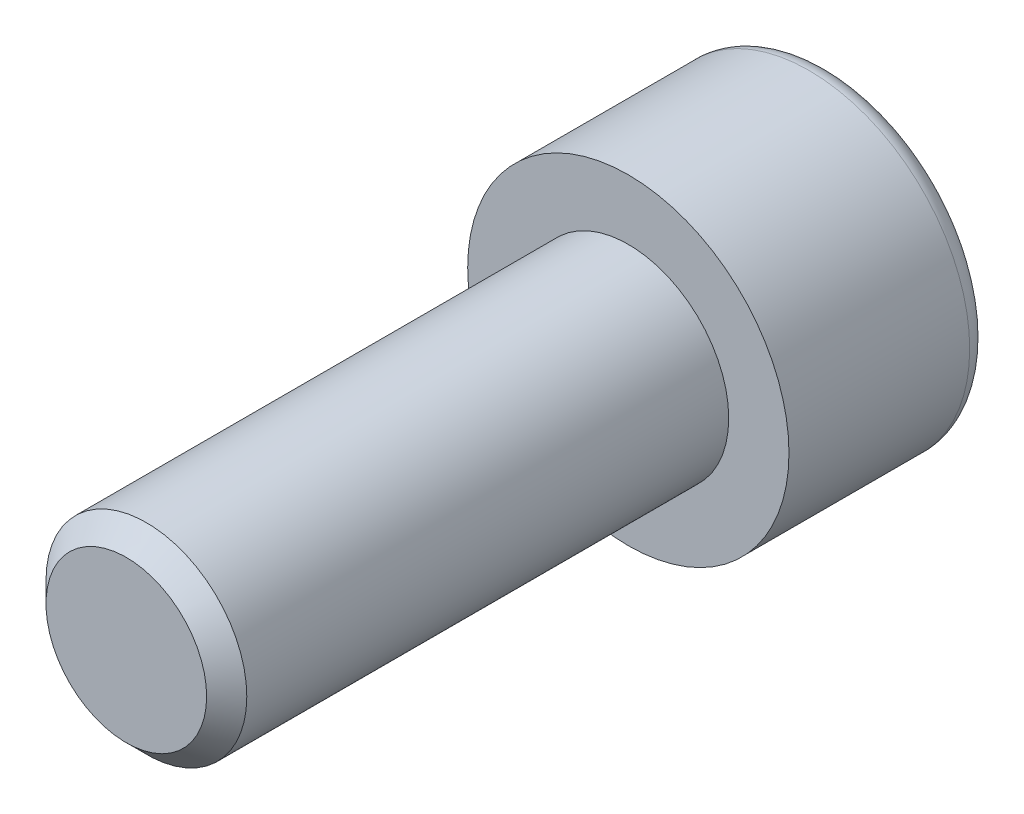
ISO-10303-21;
HEADER;
FILE_DESCRIPTION(('STEP AP214'),'2;1');
FILE_NAME('part.step','',(''),(''),'','','');
FILE_SCHEMA(('AUTOMOTIVE_DESIGN { 1 0 10303 214 1 1 1 1 }'));
ENDSEC;
DATA;
#1=APPLICATION_CONTEXT('core data for automotive mechanical design processes');
#2=APPLICATION_PROTOCOL_DEFINITION('international standard','automotive_design',2000,#1);
#3=PRODUCT_CONTEXT('',#1,'mechanical');
#4=PRODUCT('Part','Part','',(#3));
#5=PRODUCT_RELATED_PRODUCT_CATEGORY('part','',(#4));
#6=PRODUCT_DEFINITION_FORMATION('','',#4);
#7=PRODUCT_DEFINITION_CONTEXT('part definition',#1,'design');
#8=PRODUCT_DEFINITION('design','',#6,#7);
#9=PRODUCT_DEFINITION_SHAPE('','',#8);
#10=(LENGTH_UNIT() NAMED_UNIT(*) SI_UNIT(.MILLI.,.METRE.));
#11=(NAMED_UNIT(*) PLANE_ANGLE_UNIT() SI_UNIT($,.RADIAN.));
#12=(NAMED_UNIT(*) SI_UNIT($,.STERADIAN.) SOLID_ANGLE_UNIT());
#13=UNCERTAINTY_MEASURE_WITH_UNIT(LENGTH_MEASURE(1.E-05),#10,'distance_accuracy_value','');
#14=(GEOMETRIC_REPRESENTATION_CONTEXT(3) GLOBAL_UNCERTAINTY_ASSIGNED_CONTEXT((#13)) GLOBAL_UNIT_ASSIGNED_CONTEXT((#10,
#11,#12)) REPRESENTATION_CONTEXT('',''));
#15=CARTESIAN_POINT('',(0.,0.,0.));
#16=DIRECTION('',(0.,0.,1.));
#17=DIRECTION('',(1.,0.,0.));
#18=AXIS2_PLACEMENT_3D('',#15,#16,#17);
#19=CARTESIAN_POINT('',(0.,0.,-10.));
#20=DIRECTION('',(0.,0.,1.));
#21=DIRECTION('',(1.,0.,0.));
#22=AXIS2_PLACEMENT_3D('',#19,#20,#21);
#23=PLANE('',#22);
#24=CARTESIAN_POINT('',(0.,0.,-10.));
#25=DIRECTION('',(0.,0.,-1.));
#26=DIRECTION('',(-1.,0.,0.));
#27=AXIS2_PLACEMENT_3D('',#24,#25,#26);
#28=CIRCLE('',#27,7.);
#29=CARTESIAN_POINT('',(-7.,0.,-10.));
#30=VERTEX_POINT('',#29);
#31=EDGE_CURVE('E458',#30,#30,#28,.T.);
#32=ORIENTED_EDGE('',*,*,#31,.T.);
#33=EDGE_LOOP('',(#32));
#34=FACE_BOUND('',#33,.T.);
#35=DIRECTION('',(-0.86602540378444,0.499999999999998,0.));
#36=VECTOR('',#35,1.);
#37=CARTESIAN_POINT('',(0.,4.61880215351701,-10.));
#38=LINE('',#37,#36);
#39=CARTESIAN_POINT('',(4.,2.30940107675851,-10.));
#40=VERTEX_POINT('',#39);
#41=CARTESIAN_POINT('',(0.,4.61880215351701,-10.));
#42=VERTEX_POINT('',#41);
#43=EDGE_CURVE('E362',#40,#42,#38,.T.);
#44=ORIENTED_EDGE('',*,*,#43,.T.);
#45=DIRECTION('',(-0.866025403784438,-0.500000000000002,0.));
#46=VECTOR('',#45,1.);
#47=CARTESIAN_POINT('',(0.,4.61880215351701,-10.));
#48=LINE('',#47,#46);
#49=CARTESIAN_POINT('',(-4.,2.30940107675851,-10.));
#50=VERTEX_POINT('',#49);
#51=EDGE_CURVE('E402',#42,#50,#48,.T.);
#52=ORIENTED_EDGE('',*,*,#51,.T.);
#53=DIRECTION('',(0.,-1.,0.));
#54=VECTOR('',#53,1.);
#55=CARTESIAN_POINT('',(-4.,-2.30940107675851,-10.));
#56=LINE('',#55,#54);
#57=CARTESIAN_POINT('',(-4.,-2.30940107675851,-10.));
#58=VERTEX_POINT('',#57);
#59=EDGE_CURVE('E410',#50,#58,#56,.T.);
#60=ORIENTED_EDGE('',*,*,#59,.T.);
#61=DIRECTION('',(0.866025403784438,-0.500000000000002,0.));
#62=VECTOR('',#61,1.);
#63=CARTESIAN_POINT('',(0.,-4.61880215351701,-10.));
#64=LINE('',#63,#62);
#65=CARTESIAN_POINT('',(0.,-4.61880215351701,-10.));
#66=VERTEX_POINT('',#65);
#67=EDGE_CURVE('E428',#58,#66,#64,.T.);
#68=ORIENTED_EDGE('',*,*,#67,.T.);
#69=DIRECTION('',(0.86602540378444,0.499999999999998,0.));
#70=VECTOR('',#69,1.);
#71=CARTESIAN_POINT('',(0.,-4.61880215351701,-10.));
#72=LINE('',#71,#70);
#73=CARTESIAN_POINT('',(4.,-2.30940107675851,-10.));
#74=VERTEX_POINT('',#73);
#75=EDGE_CURVE('E431',#66,#74,#72,.T.);
#76=ORIENTED_EDGE('',*,*,#75,.T.);
#77=DIRECTION('',(0.,1.,0.));
#78=VECTOR('',#77,1.);
#79=CARTESIAN_POINT('',(4.,-2.30940107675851,-10.));
#80=LINE('',#79,#78);
#81=EDGE_CURVE('E421',#74,#40,#80,.T.);
#82=ORIENTED_EDGE('',*,*,#81,.T.);
#83=EDGE_LOOP('',(#44,#52,#60,#68,#76,#82));
#84=FACE_BOUND('',#83,.T.);
#85=ADVANCED_FACE('F348',(#34,#84),#23,.F.);
#86=CARTESIAN_POINT('',(0.,0.,-9.));
#87=DIRECTION('',(0.,0.,-1.));
#88=DIRECTION('',(-1.,0.,0.));
#89=AXIS2_PLACEMENT_3D('',#86,#87,#88);
#90=TOROIDAL_SURFACE('',#89,7.,1.);
#91=ORIENTED_EDGE('',*,*,#31,.F.);
#92=EDGE_LOOP('',(#91));
#93=FACE_BOUND('',#92,.T.);
#94=CARTESIAN_POINT('',(0.,0.,-9.));
#95=DIRECTION('',(0.,0.,-1.));
#96=DIRECTION('',(-1.,0.,0.));
#97=AXIS2_PLACEMENT_3D('',#94,#95,#96);
#98=CIRCLE('',#97,8.);
#99=CARTESIAN_POINT('',(-8.,0.,-9.));
#100=VERTEX_POINT('',#99);
#101=EDGE_CURVE('E455',#100,#100,#98,.T.);
#102=ORIENTED_EDGE('',*,*,#101,.T.);
#103=EDGE_LOOP('',(#102));
#104=FACE_BOUND('',#103,.T.);
#105=ADVANCED_FACE('F477',(#93,#104),#90,.T.);
#106=CARTESIAN_POINT('',(0.,0.,0.));
#107=DIRECTION('',(0.,0.,-1.));
#108=DIRECTION('',(-1.,0.,0.));
#109=AXIS2_PLACEMENT_3D('',#106,#107,#108);
#110=CYLINDRICAL_SURFACE('',#109,8.);
#111=ORIENTED_EDGE('',*,*,#101,.F.);
#112=EDGE_LOOP('',(#111));
#113=FACE_BOUND('',#112,.T.);
#114=CARTESIAN_POINT('',(0.,0.,0.));
#115=DIRECTION('',(0.,0.,-1.));
#116=DIRECTION('',(-1.,0.,0.));
#117=AXIS2_PLACEMENT_3D('',#114,#115,#116);
#118=CIRCLE('',#117,8.);
#119=CARTESIAN_POINT('',(-8.,0.,0.));
#120=VERTEX_POINT('',#119);
#121=EDGE_CURVE('E416',#120,#120,#118,.T.);
#122=ORIENTED_EDGE('',*,*,#121,.T.);
#123=EDGE_LOOP('',(#122));
#124=FACE_BOUND('',#123,.T.);
#125=ADVANCED_FACE('F482',(#113,#124),#110,.T.);
#126=CARTESIAN_POINT('',(0.,0.,0.));
#127=DIRECTION('',(0.,0.,-1.));
#128=DIRECTION('',(-1.,0.,0.));
#129=AXIS2_PLACEMENT_3D('',#126,#127,#128);
#130=PLANE('',#129);
#131=CARTESIAN_POINT('',(0.,0.,0.));
#132=DIRECTION('',(0.,0.,1.));
#133=DIRECTION('',(1.,0.,0.));
#134=AXIS2_PLACEMENT_3D('',#131,#132,#133);
#135=CIRCLE('',#134,5.);
#136=CARTESIAN_POINT('',(5.,0.,0.));
#137=VERTEX_POINT('',#136);
#138=EDGE_CURVE('E422',#137,#137,#135,.T.);
#139=ORIENTED_EDGE('',*,*,#138,.F.);
#140=EDGE_LOOP('',(#139));
#141=FACE_BOUND('',#140,.T.);
#142=ORIENTED_EDGE('',*,*,#121,.F.);
#143=EDGE_LOOP('',(#142));
#144=FACE_BOUND('',#143,.T.);
#145=ADVANCED_FACE('F490',(#141,#144),#130,.F.);
#146=CARTESIAN_POINT('',(0.,4.61880215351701,-4.5));
#147=DIRECTION('',(-0.499999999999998,-0.86602540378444,0.));
#148=DIRECTION('',(0.86602540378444,-0.499999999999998,0.));
#149=AXIS2_PLACEMENT_3D('',#146,#147,#148);
#150=PLANE('',#149);
#151=ORIENTED_EDGE('',*,*,#43,.F.);
#152=DIRECTION('',(0.,0.,-1.));
#153=VECTOR('',#152,1.);
#154=CARTESIAN_POINT('',(4.,2.30940107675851,-4.5));
#155=LINE('',#154,#153);
#156=CARTESIAN_POINT('',(4.,2.30940107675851,-4.5));
#157=VERTEX_POINT('',#156);
#158=EDGE_CURVE('E444',#157,#40,#155,.T.);
#159=ORIENTED_EDGE('',*,*,#158,.F.);
#160=DIRECTION('',(-0.86602540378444,0.499999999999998,0.));
#161=VECTOR('',#160,1.);
#162=CARTESIAN_POINT('',(0.,4.61880215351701,-4.5));
#163=LINE('',#162,#161);
#164=CARTESIAN_POINT('',(0.,4.61880215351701,-4.5));
#165=VERTEX_POINT('',#164);
#166=EDGE_CURVE('E415',#157,#165,#163,.T.);
#167=ORIENTED_EDGE('',*,*,#166,.T.);
#168=DIRECTION('',(0.,0.,-1.));
#169=VECTOR('',#168,1.);
#170=CARTESIAN_POINT('',(0.,4.61880215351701,-4.5));
#171=LINE('',#170,#169);
#172=EDGE_CURVE('E404',#165,#42,#171,.T.);
#173=ORIENTED_EDGE('',*,*,#172,.T.);
#174=EDGE_LOOP('',(#151,#159,#167,#173));
#175=FACE_BOUND('',#174,.T.);
#176=ADVANCED_FACE('F413',(#175),#150,.T.);
#177=CARTESIAN_POINT('',(0.,4.61880215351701,-4.5));
#178=DIRECTION('',(0.500000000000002,-0.866025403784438,0.));
#179=DIRECTION('',(0.866025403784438,0.500000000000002,0.));
#180=AXIS2_PLACEMENT_3D('',#177,#178,#179);
#181=PLANE('',#180);
#182=ORIENTED_EDGE('',*,*,#51,.F.);
#183=ORIENTED_EDGE('',*,*,#172,.F.);
#184=DIRECTION('',(-0.866025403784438,-0.500000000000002,0.));
#185=VECTOR('',#184,1.);
#186=CARTESIAN_POINT('',(0.,4.61880215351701,-4.5));
#187=LINE('',#186,#185);
#188=CARTESIAN_POINT('',(-4.,2.30940107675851,-4.5));
#189=VERTEX_POINT('',#188);
#190=EDGE_CURVE('E435',#165,#189,#187,.T.);
#191=ORIENTED_EDGE('',*,*,#190,.T.);
#192=DIRECTION('',(0.,0.,-1.));
#193=VECTOR('',#192,1.);
#194=CARTESIAN_POINT('',(-4.,2.30940107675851,-4.5));
#195=LINE('',#194,#193);
#196=EDGE_CURVE('E406',#189,#50,#195,.T.);
#197=ORIENTED_EDGE('',*,*,#196,.T.);
#198=EDGE_LOOP('',(#182,#183,#191,#197));
#199=FACE_BOUND('',#198,.T.);
#200=ADVANCED_FACE('F403',(#199),#181,.T.);
#201=CARTESIAN_POINT('',(-4.,-2.30940107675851,-4.5));
#202=DIRECTION('',(1.,0.,0.));
#203=DIRECTION('',(0.,0.,-1.));
#204=AXIS2_PLACEMENT_3D('',#201,#202,#203);
#205=PLANE('',#204);
#206=ORIENTED_EDGE('',*,*,#59,.F.);
#207=ORIENTED_EDGE('',*,*,#196,.F.);
#208=DIRECTION('',(0.,-1.,0.));
#209=VECTOR('',#208,1.);
#210=CARTESIAN_POINT('',(-4.,-2.30940107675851,-4.5));
#211=LINE('',#210,#209);
#212=CARTESIAN_POINT('',(-4.,-2.30940107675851,-4.5));
#213=VERTEX_POINT('',#212);
#214=EDGE_CURVE('E437',#189,#213,#211,.T.);
#215=ORIENTED_EDGE('',*,*,#214,.T.);
#216=DIRECTION('',(0.,0.,-1.));
#217=VECTOR('',#216,1.);
#218=CARTESIAN_POINT('',(-4.,-2.30940107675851,-4.5));
#219=LINE('',#218,#217);
#220=EDGE_CURVE('E450',#213,#58,#219,.T.);
#221=ORIENTED_EDGE('',*,*,#220,.T.);
#222=EDGE_LOOP('',(#206,#207,#215,#221));
#223=FACE_BOUND('',#222,.T.);
#224=ADVANCED_FACE('F505',(#223),#205,.T.);
#225=CARTESIAN_POINT('',(0.,-4.61880215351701,-4.5));
#226=DIRECTION('',(0.500000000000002,0.866025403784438,0.));
#227=DIRECTION('',(-0.866025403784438,0.500000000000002,0.));
#228=AXIS2_PLACEMENT_3D('',#225,#226,#227);
#229=PLANE('',#228);
#230=ORIENTED_EDGE('',*,*,#67,.F.);
#231=ORIENTED_EDGE('',*,*,#220,.F.);
#232=DIRECTION('',(0.866025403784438,-0.500000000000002,0.));
#233=VECTOR('',#232,1.);
#234=CARTESIAN_POINT('',(0.,-4.61880215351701,-4.5));
#235=LINE('',#234,#233);
#236=CARTESIAN_POINT('',(0.,-4.61880215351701,-4.5));
#237=VERTEX_POINT('',#236);
#238=EDGE_CURVE('E439',#213,#237,#235,.T.);
#239=ORIENTED_EDGE('',*,*,#238,.T.);
#240=DIRECTION('',(0.,0.,-1.));
#241=VECTOR('',#240,1.);
#242=CARTESIAN_POINT('',(0.,-4.61880215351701,-4.5));
#243=LINE('',#242,#241);
#244=EDGE_CURVE('E448',#237,#66,#243,.T.);
#245=ORIENTED_EDGE('',*,*,#244,.T.);
#246=EDGE_LOOP('',(#230,#231,#239,#245));
#247=FACE_BOUND('',#246,.T.);
#248=ADVANCED_FACE('F508',(#247),#229,.T.);
#249=CARTESIAN_POINT('',(0.,-4.61880215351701,-4.5));
#250=DIRECTION('',(-0.499999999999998,0.86602540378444,0.));
#251=DIRECTION('',(-0.86602540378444,-0.499999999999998,0.));
#252=AXIS2_PLACEMENT_3D('',#249,#250,#251);
#253=PLANE('',#252);
#254=ORIENTED_EDGE('',*,*,#75,.F.);
#255=ORIENTED_EDGE('',*,*,#244,.F.);
#256=DIRECTION('',(0.86602540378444,0.499999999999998,0.));
#257=VECTOR('',#256,1.);
#258=CARTESIAN_POINT('',(0.,-4.61880215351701,-4.5));
#259=LINE('',#258,#257);
#260=CARTESIAN_POINT('',(4.,-2.30940107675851,-4.5));
#261=VERTEX_POINT('',#260);
#262=EDGE_CURVE('E441',#237,#261,#259,.T.);
#263=ORIENTED_EDGE('',*,*,#262,.T.);
#264=DIRECTION('',(0.,0.,-1.));
#265=VECTOR('',#264,1.);
#266=CARTESIAN_POINT('',(4.,-2.30940107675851,-4.5));
#267=LINE('',#266,#265);
#268=EDGE_CURVE('E446',#261,#74,#267,.T.);
#269=ORIENTED_EDGE('',*,*,#268,.T.);
#270=EDGE_LOOP('',(#254,#255,#263,#269));
#271=FACE_BOUND('',#270,.T.);
#272=ADVANCED_FACE('F512',(#271),#253,.T.);
#273=CARTESIAN_POINT('',(4.,-2.30940107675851,-4.5));
#274=DIRECTION('',(-1.,0.,0.));
#275=DIRECTION('',(0.,0.,1.));
#276=AXIS2_PLACEMENT_3D('',#273,#274,#275);
#277=PLANE('',#276);
#278=ORIENTED_EDGE('',*,*,#81,.F.);
#279=ORIENTED_EDGE('',*,*,#268,.F.);
#280=DIRECTION('',(0.,1.,0.));
#281=VECTOR('',#280,1.);
#282=CARTESIAN_POINT('',(4.,-2.30940107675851,-4.5));
#283=LINE('',#282,#281);
#284=EDGE_CURVE('E369',#261,#157,#283,.T.);
#285=ORIENTED_EDGE('',*,*,#284,.T.);
#286=ORIENTED_EDGE('',*,*,#158,.T.);
#287=EDGE_LOOP('',(#278,#279,#285,#286));
#288=FACE_BOUND('',#287,.T.);
#289=ADVANCED_FACE('F516',(#288),#277,.T.);
#290=CARTESIAN_POINT('',(4.,2.30940107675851,-4.5));
#291=DIRECTION('',(0.,0.,1.));
#292=DIRECTION('',(1.,0.,0.));
#293=AXIS2_PLACEMENT_3D('',#290,#291,#292);
#294=PLANE('',#293);
#295=ORIENTED_EDGE('',*,*,#166,.F.);
#296=ORIENTED_EDGE('',*,*,#284,.F.);
#297=ORIENTED_EDGE('',*,*,#262,.F.);
#298=ORIENTED_EDGE('',*,*,#238,.F.);
#299=ORIENTED_EDGE('',*,*,#214,.F.);
#300=ORIENTED_EDGE('',*,*,#190,.F.);
#301=EDGE_LOOP('',(#295,#296,#297,#298,#299,#300));
#302=FACE_BOUND('',#301,.T.);
#303=ADVANCED_FACE('F520',(#302),#294,.F.);
#304=CARTESIAN_POINT('',(0.,0.,25.));
#305=DIRECTION('',(0.,0.,1.));
#306=DIRECTION('',(1.,0.,0.));
#307=AXIS2_PLACEMENT_3D('',#304,#305,#306);
#308=PLANE('',#307);
#309=CARTESIAN_POINT('',(0.,0.,25.));
#310=DIRECTION('',(0.,0.,1.));
#311=DIRECTION('',(1.,0.,0.));
#312=AXIS2_PLACEMENT_3D('',#309,#310,#311);
#313=CIRCLE('',#312,4.);
#314=CARTESIAN_POINT('',(4.00000000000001,0.,25.));
#315=VERTEX_POINT('',#314);
#316=EDGE_CURVE('E355',#315,#315,#313,.T.);
#317=ORIENTED_EDGE('',*,*,#316,.T.);
#318=EDGE_LOOP('',(#317));
#319=FACE_BOUND('',#318,.T.);
#320=ADVANCED_FACE('F463',(#319),#308,.T.);
#321=CARTESIAN_POINT('',(0.,0.,0.));
#322=DIRECTION('',(0.,0.,1.));
#323=DIRECTION('',(1.,0.,0.));
#324=AXIS2_PLACEMENT_3D('',#321,#322,#323);
#325=CYLINDRICAL_SURFACE('',#324,5.);
#326=CARTESIAN_POINT('',(0.,0.,24.));
#327=DIRECTION('',(0.,0.,1.));
#328=DIRECTION('',(1.,0.,0.));
#329=AXIS2_PLACEMENT_3D('',#326,#327,#328);
#330=CIRCLE('',#329,5.);
#331=CARTESIAN_POINT('',(5.,0.,24.));
#332=VERTEX_POINT('',#331);
#333=EDGE_CURVE('E11',#332,#332,#330,.F.);
#334=ORIENTED_EDGE('',*,*,#333,.T.);
#335=EDGE_LOOP('',(#334));
#336=FACE_BOUND('',#335,.T.);
#337=ORIENTED_EDGE('',*,*,#138,.T.);
#338=EDGE_LOOP('',(#337));
#339=FACE_BOUND('',#338,.T.);
#340=ADVANCED_FACE('F467',(#336,#339),#325,.T.);
#341=CARTESIAN_POINT('',(0.,0.,25.));
#342=DIRECTION('',(0.,0.,-1.));
#343=DIRECTION('',(-1.,0.,0.));
#344=AXIS2_PLACEMENT_3D('',#341,#342,#343);
#345=CONICAL_SURFACE('',#344,4.,0.785398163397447);
#346=ORIENTED_EDGE('',*,*,#333,.F.);
#347=EDGE_LOOP('',(#346));
#348=FACE_BOUND('',#347,.T.);
#349=ORIENTED_EDGE('',*,*,#316,.F.);
#350=EDGE_LOOP('',(#349));
#351=FACE_BOUND('',#350,.T.);
#352=ADVANCED_FACE('F465',(#348,#351),#345,.T.);
#353=CLOSED_SHELL('',(#85,#105,#125,#145,#176,#200,#224,#248,#272,#289,#303,#320,#340,#352));
#354=MANIFOLD_SOLID_BREP('B2',#353);
#355=ADVANCED_BREP_SHAPE_REPRESENTATION('',(#18,#354),#14);
#356=SHAPE_DEFINITION_REPRESENTATION(#9,#355);
ENDSEC;
END-ISO-10303-21;
